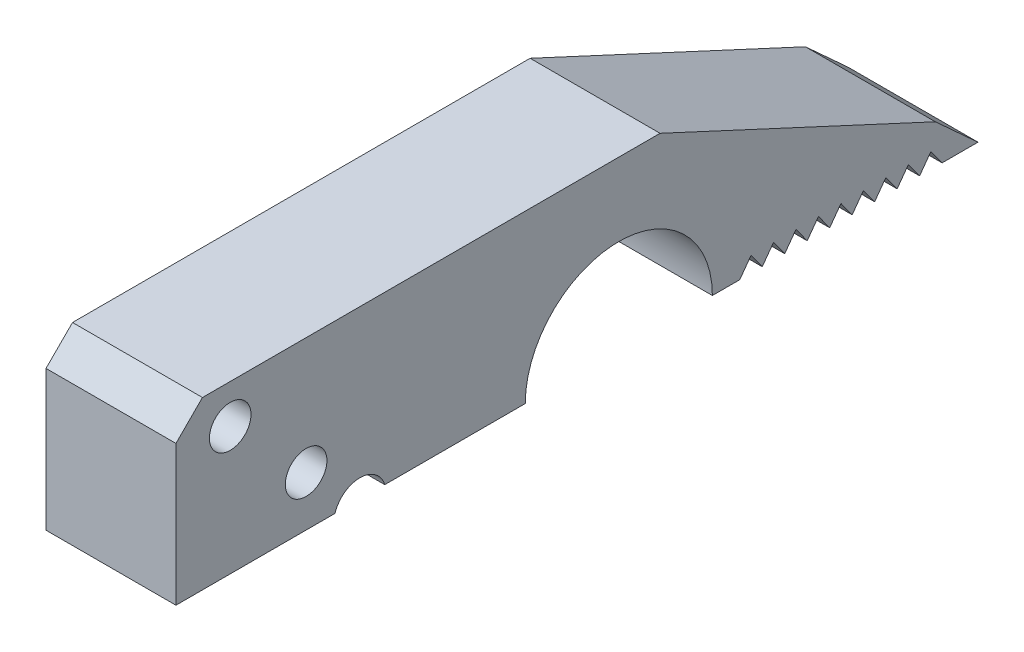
from build123d import *

# Parameters (mm, degrees)
SKETCH7_R           = 1.6
BOSS_EXTRUDE2_DEPTH = 10


with BuildPart() as part:
    # Sketch7 → Boss-Extrude2 (new body)
    with BuildSketch(Plane(origin=(0, 0, 0), x_dir=(0, 0, -1), z_dir=(1, 0, 0))):
        with BuildLine():
            Line((-10.790231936, -1.406745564), (-10.790231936, 9.378687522))
            Line((-10.790231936, 9.378687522), (-8.750256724, 11.418662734))
            Line((-8.750256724, 11.418662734), (26.465432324, 11.418662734))
            Line((26.465432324, 11.418662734), (47.651644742, 1.593543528))
            Line((47.651644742, 1.593543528), (50.933165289, -1.406745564))
            Line((50.933165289, -1.406745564), (48.171101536, -1.406745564))
            Line((48.171101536, -1.406745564), (47.306101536, -0.216175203))
            Line((47.306101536, -0.216175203), (46.441101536, -1.406745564))
            Line((46.441101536, -1.406745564), (45.576101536, -0.216175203))
            Line((45.576101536, -0.216175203), (44.711101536, -1.406745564))
            Line((44.711101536, -1.406745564), (43.846101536, -0.216175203))
            Line((43.846101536, -0.216175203), (42.981101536, -1.406745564))
            Line((42.981101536, -1.406745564), (42.116101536, -0.216175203))
            Line((42.116101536, -0.216175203), (41.251101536, -1.406745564))
            Line((41.251101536, -1.406745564), (40.386101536, -0.216175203))
            Line((40.386101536, -0.216175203), (39.521101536, -1.406745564))
            Line((39.521101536, -1.406745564), (38.656101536, -0.216175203))
            Line((38.656101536, -0.216175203), (37.791101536, -1.406745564))
            Line((37.791101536, -1.406745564), (36.926101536, -0.216175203))
            Line((36.926101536, -0.216175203), (36.061101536, -1.406745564))
            Line((36.061101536, -1.406745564), (35.196101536, -0.216175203))
            Line((35.196101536, -0.216175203), (34.331101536, -1.406745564))
            Line((34.331101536, -1.406745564), (33.466101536, -0.216175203))
            Line((33.466101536, -0.216175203), (32.601101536, -1.406745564))
            Line((32.601101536, -1.406745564), (30.492262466, -1.406745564))
            ThreePointArc((30.492262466, -1.406745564), (23.292262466, 5.793254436), (16.092262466, -1.406745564))
            Line((16.092262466, -1.406745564), (5.27884494, -1.406745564))
            ThreePointArc((5.27884494, -1.406745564), (3.365609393, 0.010562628), (1.452373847, -1.406745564))
            Line((1.452373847, -1.406745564), (-10.790231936, -1.406745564))
        make_face()
        with Locations((-6.61369819, 8.429806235)):
            Circle(SKETCH7_R, mode=Mode.SUBTRACT)
        with Locations((-0.772529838, 2.433695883)):
            Circle(SKETCH7_R, mode=Mode.SUBTRACT)
    extrude(amount=BOSS_EXTRUDE2_DEPTH)


solid = part.part
